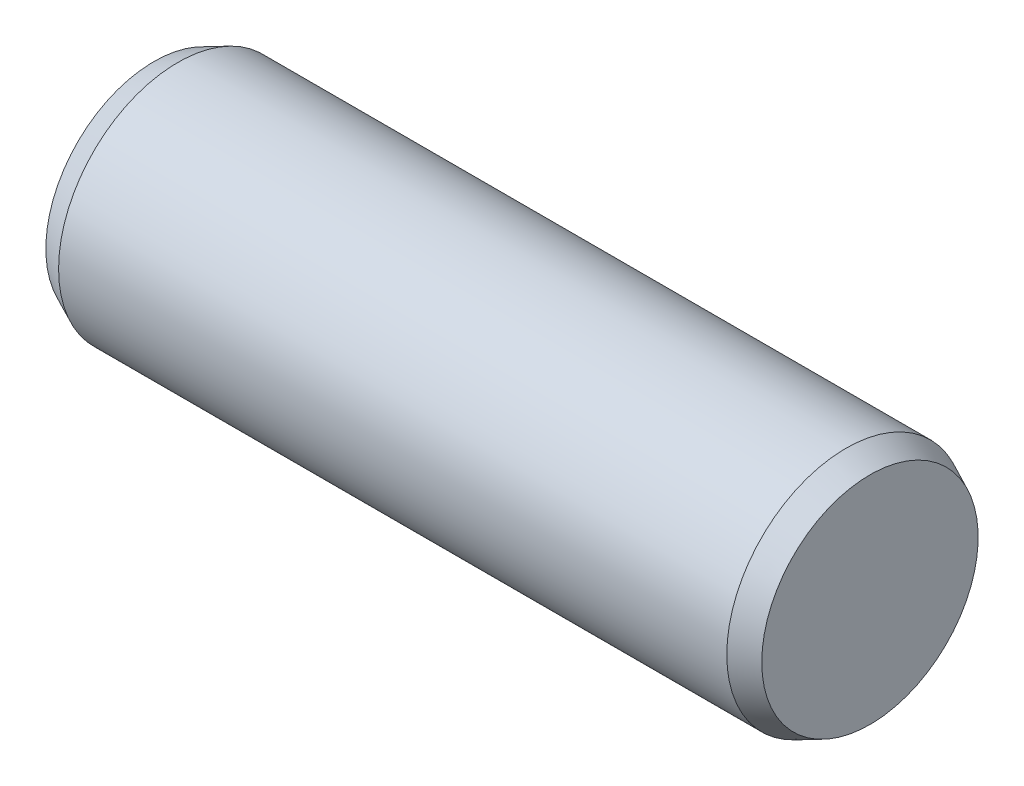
from build123d import *

# Parameters (mm, degrees)
SKETCH_1_W      = 30
SKETCH_1_H      = 5
CHAMFER_1_SIZE  = 1
CHAMFER_1_SIZE2 = 0.466307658


with BuildPart() as part:
    # Sketch 1 → Revolve 1 (revolve)
    with BuildSketch(Plane.XY, mode=Mode.PRIVATE) as revolve_1_sk:
        with Locations((15, 2.5)):
            Rectangle(SKETCH_1_W, SKETCH_1_H)
    revolve(revolve_1_sk.sketch.rotate(Axis((0, 0, 0), (1, 0, 0)), 90), axis=Axis((0, 0, 0), (1, 0, 0)))

    # Chamfer 1
    chamfer_1_edges = [part.edges().sort_by_distance(p)[0] for p in [
        (30, 0, -5),
        (0, 0, -5),
    ]]
    chamfer_1_side = [part.faces().sort_by_distance(p)[0] for p in [
        (15, 0, -5),
    ]]
    chamfer(chamfer_1_edges, length=CHAMFER_1_SIZE, length2=CHAMFER_1_SIZE2, reference=chamfer_1_side[0])


solid = part.part
